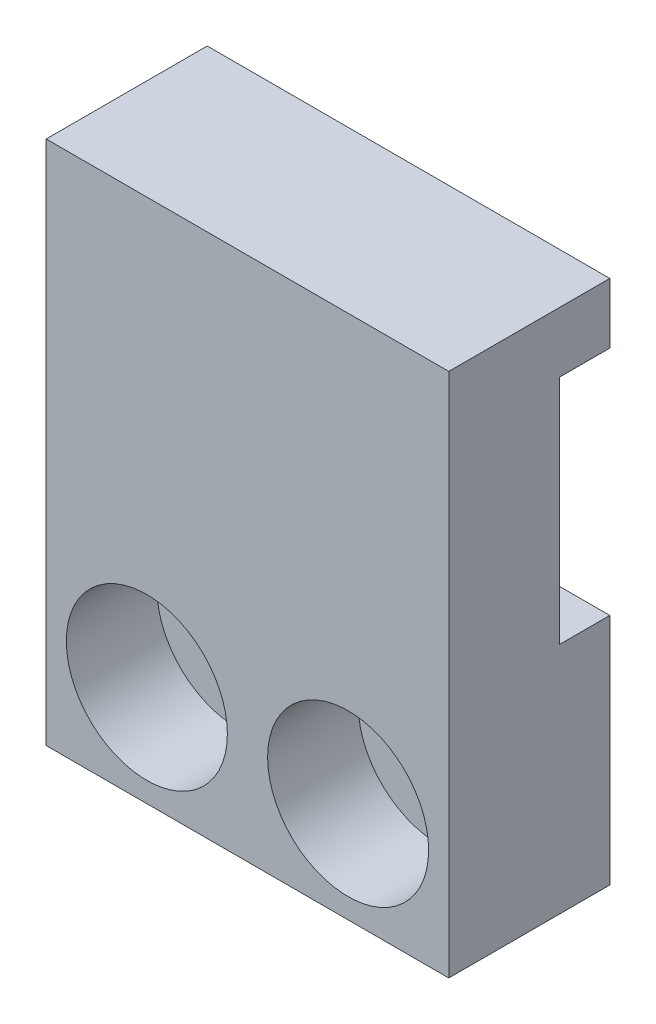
ISO-10303-21;
HEADER;
FILE_DESCRIPTION(('STEP AP214'),'2;1');
FILE_NAME('part.step','',(''),(''),'','','');
FILE_SCHEMA(('AUTOMOTIVE_DESIGN { 1 0 10303 214 1 1 1 1 }'));
ENDSEC;
DATA;
#1=APPLICATION_CONTEXT('core data for automotive mechanical design processes');
#2=APPLICATION_PROTOCOL_DEFINITION('international standard','automotive_design',2000,#1);
#3=PRODUCT_CONTEXT('',#1,'mechanical');
#4=PRODUCT('Part','Part','',(#3));
#5=PRODUCT_RELATED_PRODUCT_CATEGORY('part','',(#4));
#6=PRODUCT_DEFINITION_FORMATION('','',#4);
#7=PRODUCT_DEFINITION_CONTEXT('part definition',#1,'design');
#8=PRODUCT_DEFINITION('design','',#6,#7);
#9=PRODUCT_DEFINITION_SHAPE('','',#8);
#10=(LENGTH_UNIT() NAMED_UNIT(*) SI_UNIT(.MILLI.,.METRE.));
#11=(NAMED_UNIT(*) PLANE_ANGLE_UNIT() SI_UNIT($,.RADIAN.));
#12=(NAMED_UNIT(*) SI_UNIT($,.STERADIAN.) SOLID_ANGLE_UNIT());
#13=UNCERTAINTY_MEASURE_WITH_UNIT(LENGTH_MEASURE(1.E-05),#10,'distance_accuracy_value','');
#14=(GEOMETRIC_REPRESENTATION_CONTEXT(3) GLOBAL_UNCERTAINTY_ASSIGNED_CONTEXT((#13)) GLOBAL_UNIT_ASSIGNED_CONTEXT((#10,
#11,#12)) REPRESENTATION_CONTEXT('',''));
#15=CARTESIAN_POINT('',(0.,0.,0.));
#16=DIRECTION('',(0.,0.,1.));
#17=DIRECTION('',(1.,0.,0.));
#18=AXIS2_PLACEMENT_3D('',#15,#16,#17);
#19=CARTESIAN_POINT('',(0.,26.1,0.));
#20=DIRECTION('',(0.,0.,-1.));
#21=DIRECTION('',(-1.,0.,0.));
#22=AXIS2_PLACEMENT_3D('',#19,#20,#21);
#23=PLANE('',#22);
#24=DIRECTION('',(-1.,0.,0.));
#25=VECTOR('',#24,1.);
#26=CARTESIAN_POINT('',(65.7386894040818,11.6,0.));
#27=LINE('',#26,#25);
#28=CARTESIAN_POINT('',(20.,11.6,0.));
#29=VERTEX_POINT('',#28);
#30=CARTESIAN_POINT('',(0.,11.6,0.));
#31=VERTEX_POINT('',#30);
#32=EDGE_CURVE('E114',#29,#31,#27,.T.);
#33=ORIENTED_EDGE('',*,*,#32,.F.);
#34=DIRECTION('',(0.,1.,0.));
#35=VECTOR('',#34,1.);
#36=CARTESIAN_POINT('',(20.,0.,0.));
#37=LINE('',#36,#35);
#38=CARTESIAN_POINT('',(20.,0.,0.));
#39=VERTEX_POINT('',#38);
#40=EDGE_CURVE('E134',#39,#29,#37,.T.);
#41=ORIENTED_EDGE('',*,*,#40,.F.);
#42=DIRECTION('',(1.,0.,0.));
#43=VECTOR('',#42,1.);
#44=CARTESIAN_POINT('',(0.,0.,0.));
#45=LINE('',#44,#43);
#46=CARTESIAN_POINT('',(0.,0.,0.));
#47=VERTEX_POINT('',#46);
#48=EDGE_CURVE('E126',#47,#39,#45,.T.);
#49=ORIENTED_EDGE('',*,*,#48,.F.);
#50=DIRECTION('',(0.,-1.,0.));
#51=VECTOR('',#50,1.);
#52=CARTESIAN_POINT('',(0.,0.,0.));
#53=LINE('',#52,#51);
#54=EDGE_CURVE('E127',#31,#47,#53,.T.);
#55=ORIENTED_EDGE('',*,*,#54,.F.);
#56=EDGE_LOOP('',(#33,#41,#49,#55));
#57=FACE_BOUND('',#56,.T.);
#58=CARTESIAN_POINT('',(15.,5.00000000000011,0.));
#59=DIRECTION('',(0.,0.,1.));
#60=DIRECTION('',(1.,0.,0.));
#61=AXIS2_PLACEMENT_3D('',#58,#59,#60);
#62=CIRCLE('',#61,2.25);
#63=CARTESIAN_POINT('',(17.25,5.00000000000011,0.));
#64=VERTEX_POINT('',#63);
#65=EDGE_CURVE('E151',#64,#64,#62,.T.);
#66=ORIENTED_EDGE('',*,*,#65,.T.);
#67=EDGE_LOOP('',(#66));
#68=FACE_BOUND('',#67,.T.);
#69=CARTESIAN_POINT('',(5.,5.00000000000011,0.));
#70=DIRECTION('',(0.,0.,1.));
#71=DIRECTION('',(1.,0.,0.));
#72=AXIS2_PLACEMENT_3D('',#69,#70,#71);
#73=CIRCLE('',#72,2.25);
#74=CARTESIAN_POINT('',(7.25,5.00000000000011,0.));
#75=VERTEX_POINT('',#74);
#76=EDGE_CURVE('E130',#75,#75,#73,.T.);
#77=ORIENTED_EDGE('',*,*,#76,.T.);
#78=EDGE_LOOP('',(#77));
#79=FACE_BOUND('',#78,.T.);
#80=ADVANCED_FACE('F32',(#57,#68,#79),#23,.T.);
#81=CARTESIAN_POINT('',(15.,5.00000000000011,8.));
#82=DIRECTION('',(0.,0.,-1.));
#83=DIRECTION('',(-1.,0.,0.));
#84=AXIS2_PLACEMENT_3D('',#81,#82,#83);
#85=CYLINDRICAL_SURFACE('',#84,2.25);
#86=ORIENTED_EDGE('',*,*,#65,.F.);
#87=EDGE_LOOP('',(#86));
#88=FACE_BOUND('',#87,.T.);
#89=CARTESIAN_POINT('',(15.,5.00000000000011,3.5));
#90=DIRECTION('',(0.,0.,1.));
#91=DIRECTION('',(1.,0.,0.));
#92=AXIS2_PLACEMENT_3D('',#89,#90,#91);
#93=CIRCLE('',#92,2.25);
#94=CARTESIAN_POINT('',(17.25,5.00000000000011,3.5));
#95=VERTEX_POINT('',#94);
#96=EDGE_CURVE('E153',#95,#95,#93,.T.);
#97=ORIENTED_EDGE('',*,*,#96,.T.);
#98=EDGE_LOOP('',(#97));
#99=FACE_BOUND('',#98,.T.);
#100=ADVANCED_FACE('F203',(#88,#99),#85,.F.);
#101=CARTESIAN_POINT('',(5.,5.00000000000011,8.));
#102=DIRECTION('',(0.,0.,-1.));
#103=DIRECTION('',(-1.,0.,0.));
#104=AXIS2_PLACEMENT_3D('',#101,#102,#103);
#105=CYLINDRICAL_SURFACE('',#104,2.25);
#106=ORIENTED_EDGE('',*,*,#76,.F.);
#107=EDGE_LOOP('',(#106));
#108=FACE_BOUND('',#107,.T.);
#109=CARTESIAN_POINT('',(5.,5.00000000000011,3.5));
#110=DIRECTION('',(0.,0.,1.));
#111=DIRECTION('',(1.,0.,0.));
#112=AXIS2_PLACEMENT_3D('',#109,#110,#111);
#113=CIRCLE('',#112,2.25);
#114=CARTESIAN_POINT('',(7.25,5.00000000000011,3.5));
#115=VERTEX_POINT('',#114);
#116=EDGE_CURVE('E148',#115,#115,#113,.T.);
#117=ORIENTED_EDGE('',*,*,#116,.T.);
#118=EDGE_LOOP('',(#117));
#119=FACE_BOUND('',#118,.T.);
#120=ADVANCED_FACE('F209',(#108,#119),#105,.F.);
#121=CARTESIAN_POINT('',(0.,26.1,8.));
#122=DIRECTION('',(0.,0.,-1.));
#123=DIRECTION('',(-1.,0.,0.));
#124=AXIS2_PLACEMENT_3D('',#121,#122,#123);
#125=PLANE('',#124);
#126=CARTESIAN_POINT('',(15.,5.00000000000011,8.));
#127=DIRECTION('',(0.,0.,1.));
#128=DIRECTION('',(1.,0.,0.));
#129=AXIS2_PLACEMENT_3D('',#126,#127,#128);
#130=CIRCLE('',#129,4.);
#131=CARTESIAN_POINT('',(19.,5.00000000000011,8.));
#132=VERTEX_POINT('',#131);
#133=EDGE_CURVE('E176',#132,#132,#130,.T.);
#134=ORIENTED_EDGE('',*,*,#133,.F.);
#135=EDGE_LOOP('',(#134));
#136=FACE_BOUND('',#135,.T.);
#137=CARTESIAN_POINT('',(5.,5.00000000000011,8.));
#138=DIRECTION('',(0.,0.,1.));
#139=DIRECTION('',(1.,0.,0.));
#140=AXIS2_PLACEMENT_3D('',#137,#138,#139);
#141=CIRCLE('',#140,4.);
#142=CARTESIAN_POINT('',(9.,5.00000000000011,8.));
#143=VERTEX_POINT('',#142);
#144=EDGE_CURVE('E156',#143,#143,#141,.T.);
#145=ORIENTED_EDGE('',*,*,#144,.F.);
#146=EDGE_LOOP('',(#145));
#147=FACE_BOUND('',#146,.T.);
#148=DIRECTION('',(0.,-1.,0.));
#149=VECTOR('',#148,1.);
#150=CARTESIAN_POINT('',(0.,0.,8.));
#151=LINE('',#150,#149);
#152=CARTESIAN_POINT('',(0.,26.1,8.));
#153=VERTEX_POINT('',#152);
#154=CARTESIAN_POINT('',(0.,0.,8.));
#155=VERTEX_POINT('',#154);
#156=EDGE_CURVE('E138',#153,#155,#151,.T.);
#157=ORIENTED_EDGE('',*,*,#156,.T.);
#158=DIRECTION('',(1.,0.,0.));
#159=VECTOR('',#158,1.);
#160=CARTESIAN_POINT('',(0.,0.,8.));
#161=LINE('',#160,#159);
#162=CARTESIAN_POINT('',(20.,0.,8.));
#163=VERTEX_POINT('',#162);
#164=EDGE_CURVE('E85',#155,#163,#161,.T.);
#165=ORIENTED_EDGE('',*,*,#164,.T.);
#166=DIRECTION('',(0.,1.,0.));
#167=VECTOR('',#166,1.);
#168=CARTESIAN_POINT('',(20.,0.,8.));
#169=LINE('',#168,#167);
#170=CARTESIAN_POINT('',(20.,26.1,8.));
#171=VERTEX_POINT('',#170);
#172=EDGE_CURVE('E190',#163,#171,#169,.T.);
#173=ORIENTED_EDGE('',*,*,#172,.T.);
#174=DIRECTION('',(-1.,0.,0.));
#175=VECTOR('',#174,1.);
#176=CARTESIAN_POINT('',(0.,26.1,8.));
#177=LINE('',#176,#175);
#178=EDGE_CURVE('E56',#171,#153,#177,.T.);
#179=ORIENTED_EDGE('',*,*,#178,.T.);
#180=EDGE_LOOP('',(#157,#165,#173,#179));
#181=FACE_BOUND('',#180,.T.);
#182=ADVANCED_FACE('F193',(#136,#147,#181),#125,.F.);
#183=DIRECTION('',(-1.,0.,0.));
#184=VECTOR('',#183,1.);
#185=CARTESIAN_POINT('',(65.7386894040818,23.0999999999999,0.));
#186=LINE('',#185,#184);
#187=CARTESIAN_POINT('',(20.,23.0999999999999,0.));
#188=VERTEX_POINT('',#187);
#189=CARTESIAN_POINT('',(0.,23.0999999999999,0.));
#190=VERTEX_POINT('',#189);
#191=EDGE_CURVE('E47',#188,#190,#186,.T.);
#192=ORIENTED_EDGE('',*,*,#191,.T.);
#193=CARTESIAN_POINT('',(0.,26.1,0.));
#194=VERTEX_POINT('',#193);
#195=EDGE_CURVE('E120',#194,#190,#53,.T.);
#196=ORIENTED_EDGE('',*,*,#195,.F.);
#197=DIRECTION('',(-1.,0.,0.));
#198=VECTOR('',#197,1.);
#199=CARTESIAN_POINT('',(0.,26.1,0.));
#200=LINE('',#199,#198);
#201=CARTESIAN_POINT('',(20.,26.1,0.));
#202=VERTEX_POINT('',#201);
#203=EDGE_CURVE('E77',#202,#194,#200,.T.);
#204=ORIENTED_EDGE('',*,*,#203,.F.);
#205=EDGE_CURVE('E121',#188,#202,#37,.T.);
#206=ORIENTED_EDGE('',*,*,#205,.F.);
#207=EDGE_LOOP('',(#192,#196,#204,#206));
#208=FACE_BOUND('',#207,.T.);
#209=ADVANCED_FACE('F119',(#208),#23,.T.);
#210=CARTESIAN_POINT('',(0.,0.,8.));
#211=DIRECTION('',(1.,0.,0.));
#212=DIRECTION('',(0.,0.,-1.));
#213=AXIS2_PLACEMENT_3D('',#210,#211,#212);
#214=PLANE('',#213);
#215=DIRECTION('',(0.,-1.,0.));
#216=VECTOR('',#215,1.);
#217=CARTESIAN_POINT('',(0.,0.,2.5));
#218=LINE('',#217,#216);
#219=CARTESIAN_POINT('',(0.,23.0999999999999,2.5));
#220=VERTEX_POINT('',#219);
#221=CARTESIAN_POINT('',(0.,11.5999999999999,2.5));
#222=VERTEX_POINT('',#221);
#223=EDGE_CURVE('E113',#220,#222,#218,.T.);
#224=ORIENTED_EDGE('',*,*,#223,.T.);
#225=DIRECTION('',(0.,0.,-1.));
#226=VECTOR('',#225,1.);
#227=CARTESIAN_POINT('',(0.,11.5999999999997,8.00000000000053));
#228=LINE('',#227,#226);
#229=EDGE_CURVE('E169',#222,#31,#228,.T.);
#230=ORIENTED_EDGE('',*,*,#229,.T.);
#231=ORIENTED_EDGE('',*,*,#54,.T.);
#232=DIRECTION('',(0.,0.,-1.));
#233=VECTOR('',#232,1.);
#234=CARTESIAN_POINT('',(0.,0.,8.));
#235=LINE('',#234,#233);
#236=EDGE_CURVE('E145',#155,#47,#235,.T.);
#237=ORIENTED_EDGE('',*,*,#236,.F.);
#238=ORIENTED_EDGE('',*,*,#156,.F.);
#239=DIRECTION('',(0.,0.,-1.));
#240=VECTOR('',#239,1.);
#241=CARTESIAN_POINT('',(0.,26.1,8.));
#242=LINE('',#241,#240);
#243=EDGE_CURVE('E125',#153,#194,#242,.T.);
#244=ORIENTED_EDGE('',*,*,#243,.T.);
#245=ORIENTED_EDGE('',*,*,#195,.T.);
#246=DIRECTION('',(0.,0.,1.));
#247=VECTOR('',#246,1.);
#248=CARTESIAN_POINT('',(0.,23.0999999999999,8.));
#249=LINE('',#248,#247);
#250=EDGE_CURVE('E106',#190,#220,#249,.T.);
#251=ORIENTED_EDGE('',*,*,#250,.T.);
#252=EDGE_LOOP('',(#224,#230,#231,#237,#238,#244,#245,#251));
#253=FACE_BOUND('',#252,.T.);
#254=ADVANCED_FACE('F34',(#253),#214,.F.);
#255=CARTESIAN_POINT('',(0.,0.,8.));
#256=DIRECTION('',(0.,1.,0.));
#257=DIRECTION('',(0.,0.,1.));
#258=AXIS2_PLACEMENT_3D('',#255,#256,#257);
#259=PLANE('',#258);
#260=ORIENTED_EDGE('',*,*,#48,.T.);
#261=DIRECTION('',(0.,0.,-1.));
#262=VECTOR('',#261,1.);
#263=CARTESIAN_POINT('',(20.,0.,8.));
#264=LINE('',#263,#262);
#265=EDGE_CURVE('E142',#163,#39,#264,.T.);
#266=ORIENTED_EDGE('',*,*,#265,.F.);
#267=ORIENTED_EDGE('',*,*,#164,.F.);
#268=ORIENTED_EDGE('',*,*,#236,.T.);
#269=EDGE_LOOP('',(#260,#266,#267,#268));
#270=FACE_BOUND('',#269,.T.);
#271=ADVANCED_FACE('F198',(#270),#259,.F.);
#272=CARTESIAN_POINT('',(20.,0.,8.));
#273=DIRECTION('',(-1.,0.,0.));
#274=DIRECTION('',(0.,0.,1.));
#275=AXIS2_PLACEMENT_3D('',#272,#273,#274);
#276=PLANE('',#275);
#277=ORIENTED_EDGE('',*,*,#40,.T.);
#278=DIRECTION('',(0.,0.,1.));
#279=VECTOR('',#278,1.);
#280=CARTESIAN_POINT('',(20.,11.5999999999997,8.00000000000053));
#281=LINE('',#280,#279);
#282=CARTESIAN_POINT('',(20.,11.5999999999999,2.5));
#283=VERTEX_POINT('',#282);
#284=EDGE_CURVE('E11',#29,#283,#281,.T.);
#285=ORIENTED_EDGE('',*,*,#284,.T.);
#286=DIRECTION('',(0.,1.,0.));
#287=VECTOR('',#286,1.);
#288=CARTESIAN_POINT('',(20.,0.,2.5));
#289=LINE('',#288,#287);
#290=CARTESIAN_POINT('',(20.,23.0999999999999,2.5));
#291=VERTEX_POINT('',#290);
#292=EDGE_CURVE('E40',#283,#291,#289,.T.);
#293=ORIENTED_EDGE('',*,*,#292,.T.);
#294=DIRECTION('',(0.,0.,-1.));
#295=VECTOR('',#294,1.);
#296=CARTESIAN_POINT('',(20.,23.0999999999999,8.));
#297=LINE('',#296,#295);
#298=EDGE_CURVE('E147',#291,#188,#297,.T.);
#299=ORIENTED_EDGE('',*,*,#298,.T.);
#300=ORIENTED_EDGE('',*,*,#205,.T.);
#301=DIRECTION('',(0.,0.,-1.));
#302=VECTOR('',#301,1.);
#303=CARTESIAN_POINT('',(20.,26.1,8.));
#304=LINE('',#303,#302);
#305=EDGE_CURVE('E140',#171,#202,#304,.T.);
#306=ORIENTED_EDGE('',*,*,#305,.F.);
#307=ORIENTED_EDGE('',*,*,#172,.F.);
#308=ORIENTED_EDGE('',*,*,#265,.T.);
#309=EDGE_LOOP('',(#277,#285,#293,#299,#300,#306,#307,#308));
#310=FACE_BOUND('',#309,.T.);
#311=ADVANCED_FACE('F160',(#310),#276,.F.);
#312=CARTESIAN_POINT('',(0.,26.1,8.));
#313=DIRECTION('',(0.,-1.,0.));
#314=DIRECTION('',(0.,0.,-1.));
#315=AXIS2_PLACEMENT_3D('',#312,#313,#314);
#316=PLANE('',#315);
#317=ORIENTED_EDGE('',*,*,#203,.T.);
#318=ORIENTED_EDGE('',*,*,#243,.F.);
#319=ORIENTED_EDGE('',*,*,#178,.F.);
#320=ORIENTED_EDGE('',*,*,#305,.T.);
#321=EDGE_LOOP('',(#317,#318,#319,#320));
#322=FACE_BOUND('',#321,.T.);
#323=ADVANCED_FACE('F194',(#322),#316,.F.);
#324=CARTESIAN_POINT('',(5.,5.00000000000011,3.5));
#325=DIRECTION('',(0.,0.,1.));
#326=DIRECTION('',(1.,0.,0.));
#327=AXIS2_PLACEMENT_3D('',#324,#325,#326);
#328=CYLINDRICAL_SURFACE('',#327,4.);
#329=CARTESIAN_POINT('',(5.,5.00000000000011,3.5));
#330=DIRECTION('',(0.,0.,1.));
#331=DIRECTION('',(1.,0.,0.));
#332=AXIS2_PLACEMENT_3D('',#329,#330,#331);
#333=CIRCLE('',#332,4.);
#334=CARTESIAN_POINT('',(9.,5.00000000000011,3.5));
#335=VERTEX_POINT('',#334);
#336=EDGE_CURVE('E152',#335,#335,#333,.T.);
#337=ORIENTED_EDGE('',*,*,#336,.F.);
#338=EDGE_LOOP('',(#337));
#339=FACE_BOUND('',#338,.T.);
#340=ORIENTED_EDGE('',*,*,#144,.T.);
#341=EDGE_LOOP('',(#340));
#342=FACE_BOUND('',#341,.T.);
#343=ADVANCED_FACE('F219',(#339,#342),#328,.F.);
#344=CARTESIAN_POINT('',(5.,5.00000000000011,3.5));
#345=DIRECTION('',(0.,0.,1.));
#346=DIRECTION('',(1.,0.,0.));
#347=AXIS2_PLACEMENT_3D('',#344,#345,#346);
#348=PLANE('',#347);
#349=ORIENTED_EDGE('',*,*,#116,.F.);
#350=EDGE_LOOP('',(#349));
#351=FACE_BOUND('',#350,.T.);
#352=ORIENTED_EDGE('',*,*,#336,.T.);
#353=EDGE_LOOP('',(#352));
#354=FACE_BOUND('',#353,.T.);
#355=ADVANCED_FACE('F215',(#351,#354),#348,.T.);
#356=CARTESIAN_POINT('',(15.,5.00000000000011,3.5));
#357=DIRECTION('',(0.,0.,1.));
#358=DIRECTION('',(1.,0.,0.));
#359=AXIS2_PLACEMENT_3D('',#356,#357,#358);
#360=CYLINDRICAL_SURFACE('',#359,4.);
#361=CARTESIAN_POINT('',(15.,5.00000000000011,3.5));
#362=DIRECTION('',(0.,0.,1.));
#363=DIRECTION('',(1.,0.,0.));
#364=AXIS2_PLACEMENT_3D('',#361,#362,#363);
#365=CIRCLE('',#364,4.);
#366=CARTESIAN_POINT('',(19.,5.00000000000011,3.5));
#367=VERTEX_POINT('',#366);
#368=EDGE_CURVE('E157',#367,#367,#365,.T.);
#369=ORIENTED_EDGE('',*,*,#368,.F.);
#370=EDGE_LOOP('',(#369));
#371=FACE_BOUND('',#370,.T.);
#372=ORIENTED_EDGE('',*,*,#133,.T.);
#373=EDGE_LOOP('',(#372));
#374=FACE_BOUND('',#373,.T.);
#375=ADVANCED_FACE('F218',(#371,#374),#360,.F.);
#376=CARTESIAN_POINT('',(15.,5.00000000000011,3.5));
#377=DIRECTION('',(0.,0.,1.));
#378=DIRECTION('',(1.,0.,0.));
#379=AXIS2_PLACEMENT_3D('',#376,#377,#378);
#380=PLANE('',#379);
#381=ORIENTED_EDGE('',*,*,#96,.F.);
#382=EDGE_LOOP('',(#381));
#383=FACE_BOUND('',#382,.T.);
#384=ORIENTED_EDGE('',*,*,#368,.T.);
#385=EDGE_LOOP('',(#384));
#386=FACE_BOUND('',#385,.T.);
#387=ADVANCED_FACE('F266',(#383,#386),#380,.T.);
#388=CARTESIAN_POINT('',(65.7386894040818,11.5999999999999,2.5));
#389=DIRECTION('',(0.,-1.,0.));
#390=DIRECTION('',(0.,0.,-1.));
#391=AXIS2_PLACEMENT_3D('',#388,#389,#390);
#392=PLANE('',#391);
#393=ORIENTED_EDGE('',*,*,#229,.F.);
#394=DIRECTION('',(-1.,0.,0.));
#395=VECTOR('',#394,1.);
#396=CARTESIAN_POINT('',(65.7386894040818,11.5999999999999,2.5));
#397=LINE('',#396,#395);
#398=EDGE_CURVE('E122',#283,#222,#397,.T.);
#399=ORIENTED_EDGE('',*,*,#398,.F.);
#400=ORIENTED_EDGE('',*,*,#284,.F.);
#401=ORIENTED_EDGE('',*,*,#32,.T.);
#402=EDGE_LOOP('',(#393,#399,#400,#401));
#403=FACE_BOUND('',#402,.T.);
#404=ADVANCED_FACE('F166',(#403),#392,.F.);
#405=CARTESIAN_POINT('',(65.7386894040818,11.5999999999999,2.5));
#406=DIRECTION('',(0.,0.,1.));
#407=DIRECTION('',(1.,0.,0.));
#408=AXIS2_PLACEMENT_3D('',#405,#406,#407);
#409=PLANE('',#408);
#410=ORIENTED_EDGE('',*,*,#223,.F.);
#411=DIRECTION('',(-1.,0.,0.));
#412=VECTOR('',#411,1.);
#413=CARTESIAN_POINT('',(65.7386894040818,23.0999999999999,2.5));
#414=LINE('',#413,#412);
#415=EDGE_CURVE('E109',#291,#220,#414,.T.);
#416=ORIENTED_EDGE('',*,*,#415,.F.);
#417=ORIENTED_EDGE('',*,*,#292,.F.);
#418=ORIENTED_EDGE('',*,*,#398,.T.);
#419=EDGE_LOOP('',(#410,#416,#417,#418));
#420=FACE_BOUND('',#419,.T.);
#421=ADVANCED_FACE('F164',(#420),#409,.F.);
#422=CARTESIAN_POINT('',(65.7386894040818,23.0999999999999,2.5));
#423=DIRECTION('',(0.,1.,0.));
#424=DIRECTION('',(0.,0.,1.));
#425=AXIS2_PLACEMENT_3D('',#422,#423,#424);
#426=PLANE('',#425);
#427=ORIENTED_EDGE('',*,*,#250,.F.);
#428=ORIENTED_EDGE('',*,*,#191,.F.);
#429=ORIENTED_EDGE('',*,*,#298,.F.);
#430=ORIENTED_EDGE('',*,*,#415,.T.);
#431=EDGE_LOOP('',(#427,#428,#429,#430));
#432=FACE_BOUND('',#431,.T.);
#433=ADVANCED_FACE('F107',(#432),#426,.F.);
#434=CLOSED_SHELL('',(#80,#100,#120,#182,#209,#254,#271,#311,#323,#343,#355,#375,#387,#404,#421,#433));
#435=MANIFOLD_SOLID_BREP('B2',#434);
#436=ADVANCED_BREP_SHAPE_REPRESENTATION('',(#18,#435),#14);
#437=SHAPE_DEFINITION_REPRESENTATION(#9,#436);
ENDSEC;
END-ISO-10303-21;
